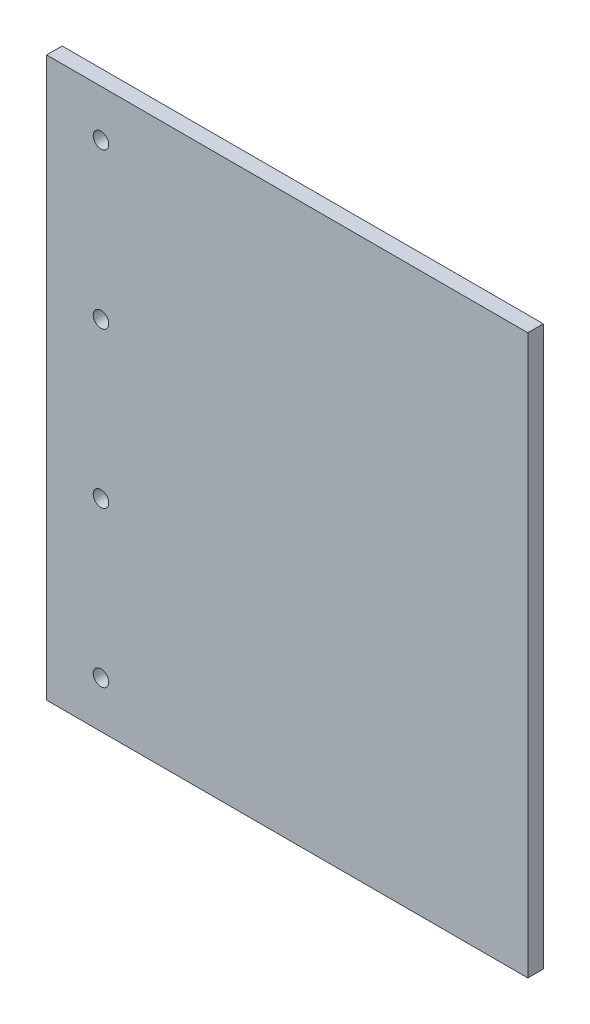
from build123d import *

# Parameters (mm, degrees)
SKETCH1_W             = 393.7
SKETCH1_H             = 457.2
PLATE_DEPTH           = 12.7
STANDARD_LINEAR_COUNT = 4
STANDARD_LINEAR_PITCH = 127


with BuildPart() as part:
    # Sketch1 → Plate (new body)
    with BuildSketch(Plane.XY):
        with Locations((196.85, 228.6)):
            Rectangle(SKETCH1_W, SKETCH1_H)
    extrude(amount=PLATE_DEPTH)

    # Sketch3 → Hole (revolve, cut)
    with BuildSketch(Plane(origin=(44.45, 38.1, 12.7), x_dir=(0, -1, 0), z_dir=(1, 0, 0))):
        Polygon((0, 0), (0, 29.215464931), (6.35, 25.4), (6.35, 0), align=None)
    hole = revolve(axis=Axis((44.45, 38.1, 19.05), (0, 0, -1)), mode=Mode.SUBTRACT)

    # Standard Linear: Hole ×4
    with Locations(*[(0, i * STANDARD_LINEAR_PITCH, 0) for i in range(1, STANDARD_LINEAR_COUNT)]):
        add(hole, mode=Mode.SUBTRACT)


solid = part.part
